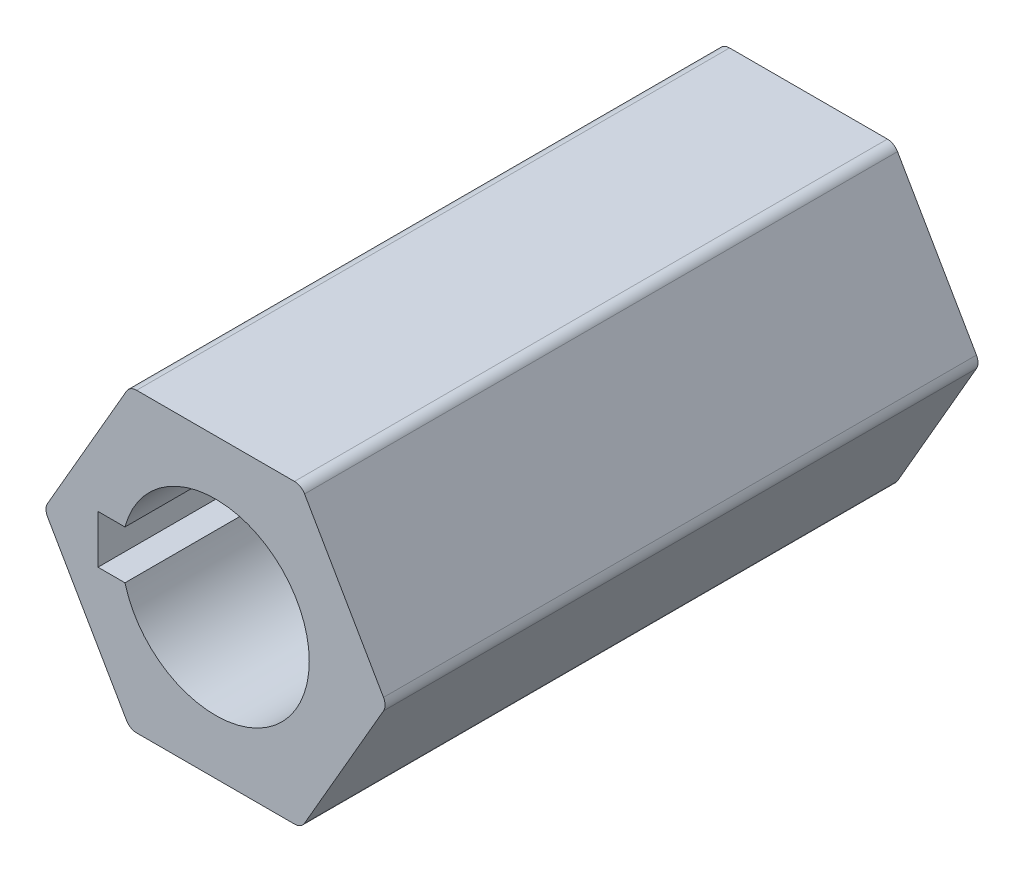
ISO-10303-21;
HEADER;
FILE_DESCRIPTION(('STEP AP214'),'2;1');
FILE_NAME('part.step','',(''),(''),'','','');
FILE_SCHEMA(('AUTOMOTIVE_DESIGN { 1 0 10303 214 1 1 1 1 }'));
ENDSEC;
DATA;
#1=APPLICATION_CONTEXT('core data for automotive mechanical design processes');
#2=APPLICATION_PROTOCOL_DEFINITION('international standard','automotive_design',2000,#1);
#3=PRODUCT_CONTEXT('',#1,'mechanical');
#4=PRODUCT('Part','Part','',(#3));
#5=PRODUCT_RELATED_PRODUCT_CATEGORY('part','',(#4));
#6=PRODUCT_DEFINITION_FORMATION('','',#4);
#7=PRODUCT_DEFINITION_CONTEXT('part definition',#1,'design');
#8=PRODUCT_DEFINITION('design','',#6,#7);
#9=PRODUCT_DEFINITION_SHAPE('','',#8);
#10=(LENGTH_UNIT() NAMED_UNIT(*) SI_UNIT(.MILLI.,.METRE.));
#11=(NAMED_UNIT(*) PLANE_ANGLE_UNIT() SI_UNIT($,.RADIAN.));
#12=(NAMED_UNIT(*) SI_UNIT($,.STERADIAN.) SOLID_ANGLE_UNIT());
#13=UNCERTAINTY_MEASURE_WITH_UNIT(LENGTH_MEASURE(1.E-05),#10,'distance_accuracy_value','');
#14=(GEOMETRIC_REPRESENTATION_CONTEXT(3) GLOBAL_UNCERTAINTY_ASSIGNED_CONTEXT((#13)) GLOBAL_UNIT_ASSIGNED_CONTEXT((#10,
#11,#12)) REPRESENTATION_CONTEXT('',''));
#15=CARTESIAN_POINT('',(0.,0.,0.));
#16=DIRECTION('',(0.,0.,1.));
#17=DIRECTION('',(1.,0.,0.));
#18=AXIS2_PLACEMENT_3D('',#15,#16,#17);
#19=CARTESIAN_POINT('',(6.76233049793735,0.,12.7));
#20=DIRECTION('',(0.,0.,-1.));
#21=DIRECTION('',(-1.,0.,0.));
#22=AXIS2_PLACEMENT_3D('',#19,#20,#21);
#23=CYLINDRICAL_SURFACE('',#22,0.5);
#24=CARTESIAN_POINT('',(6.76233049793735,0.,-12.7));
#25=DIRECTION('',(0.,0.,1.));
#26=DIRECTION('',(-1.,0.,0.));
#27=AXIS2_PLACEMENT_3D('',#24,#25,#26);
#28=CIRCLE('',#27,0.5);
#29=CARTESIAN_POINT('',(7.19534319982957,-0.250000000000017,-12.7));
#30=VERTEX_POINT('',#29);
#31=CARTESIAN_POINT('',(7.19534319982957,0.249999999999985,-12.7));
#32=VERTEX_POINT('',#31);
#33=EDGE_CURVE('E237',#30,#32,#28,.T.);
#34=ORIENTED_EDGE('',*,*,#33,.T.);
#35=DIRECTION('',(0.,0.,1.));
#36=VECTOR('',#35,1.);
#37=CARTESIAN_POINT('',(7.19534319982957,0.249999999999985,12.7));
#38=LINE('',#37,#36);
#39=CARTESIAN_POINT('',(7.19534319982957,0.249999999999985,12.7));
#40=VERTEX_POINT('',#39);
#41=EDGE_CURVE('E142',#32,#40,#38,.T.);
#42=ORIENTED_EDGE('',*,*,#41,.T.);
#43=CARTESIAN_POINT('',(6.76233049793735,0.,12.7));
#44=DIRECTION('',(0.,0.,-1.));
#45=DIRECTION('',(-1.,0.,0.));
#46=AXIS2_PLACEMENT_3D('',#43,#44,#45);
#47=CIRCLE('',#46,0.5);
#48=CARTESIAN_POINT('',(7.19534319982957,-0.250000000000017,12.7));
#49=VERTEX_POINT('',#48);
#50=EDGE_CURVE('E222',#40,#49,#47,.T.);
#51=ORIENTED_EDGE('',*,*,#50,.T.);
#52=DIRECTION('',(0.,0.,-1.));
#53=VECTOR('',#52,1.);
#54=CARTESIAN_POINT('',(7.19534319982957,-0.250000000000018,12.7));
#55=LINE('',#54,#53);
#56=EDGE_CURVE('E10',#49,#30,#55,.T.);
#57=ORIENTED_EDGE('',*,*,#56,.T.);
#58=EDGE_LOOP('',(#34,#42,#51,#57));
#59=FACE_BOUND('',#58,.T.);
#60=ADVANCED_FACE('F16',(#59),#23,.T.);
#61=CARTESIAN_POINT('',(3.38116524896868,5.85635,12.7));
#62=DIRECTION('',(0.,0.,-1.));
#63=DIRECTION('',(-1.,0.,0.));
#64=AXIS2_PLACEMENT_3D('',#61,#62,#63);
#65=CYLINDRICAL_SURFACE('',#64,0.5);
#66=CARTESIAN_POINT('',(3.38116524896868,5.85635,-12.7));
#67=DIRECTION('',(0.,0.,1.));
#68=DIRECTION('',(-1.,0.,0.));
#69=AXIS2_PLACEMENT_3D('',#66,#67,#68);
#70=CIRCLE('',#69,0.5);
#71=CARTESIAN_POINT('',(3.81417795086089,6.10635,-12.7));
#72=VERTEX_POINT('',#71);
#73=CARTESIAN_POINT('',(3.38116524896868,6.35635,-12.7));
#74=VERTEX_POINT('',#73);
#75=EDGE_CURVE('E195',#72,#74,#70,.T.);
#76=ORIENTED_EDGE('',*,*,#75,.T.);
#77=DIRECTION('',(0.,0.,1.));
#78=VECTOR('',#77,1.);
#79=CARTESIAN_POINT('',(3.38116524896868,6.35635,12.7));
#80=LINE('',#79,#78);
#81=CARTESIAN_POINT('',(3.38116524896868,6.35635,12.7));
#82=VERTEX_POINT('',#81);
#83=EDGE_CURVE('E188',#74,#82,#80,.T.);
#84=ORIENTED_EDGE('',*,*,#83,.T.);
#85=CARTESIAN_POINT('',(3.38116524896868,5.85635,12.7));
#86=DIRECTION('',(0.,0.,-1.));
#87=DIRECTION('',(-1.,0.,0.));
#88=AXIS2_PLACEMENT_3D('',#85,#86,#87);
#89=CIRCLE('',#88,0.5);
#90=CARTESIAN_POINT('',(3.81417795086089,6.10635,12.7));
#91=VERTEX_POINT('',#90);
#92=EDGE_CURVE('E192',#82,#91,#89,.T.);
#93=ORIENTED_EDGE('',*,*,#92,.T.);
#94=DIRECTION('',(0.,0.,-1.));
#95=VECTOR('',#94,1.);
#96=CARTESIAN_POINT('',(3.81417795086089,6.10635,12.7));
#97=LINE('',#96,#95);
#98=EDGE_CURVE('E178',#91,#72,#97,.T.);
#99=ORIENTED_EDGE('',*,*,#98,.T.);
#100=EDGE_LOOP('',(#76,#84,#93,#99));
#101=FACE_BOUND('',#100,.T.);
#102=ADVANCED_FACE('F190',(#101),#65,.T.);
#103=CARTESIAN_POINT('',(-3.38116524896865,5.85635,12.7));
#104=DIRECTION('',(0.,0.,-1.));
#105=DIRECTION('',(-1.,0.,0.));
#106=AXIS2_PLACEMENT_3D('',#103,#104,#105);
#107=CYLINDRICAL_SURFACE('',#106,0.5);
#108=CARTESIAN_POINT('',(-3.38116524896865,5.85635,-12.7));
#109=DIRECTION('',(0.,0.,1.));
#110=DIRECTION('',(-1.,0.,0.));
#111=AXIS2_PLACEMENT_3D('',#108,#109,#110);
#112=CIRCLE('',#111,0.5);
#113=CARTESIAN_POINT('',(-3.38116524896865,6.35635,-12.7));
#114=VERTEX_POINT('',#113);
#115=CARTESIAN_POINT('',(-3.81417795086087,6.10635,-12.7));
#116=VERTEX_POINT('',#115);
#117=EDGE_CURVE('E231',#114,#116,#112,.T.);
#118=ORIENTED_EDGE('',*,*,#117,.T.);
#119=DIRECTION('',(0.,0.,1.));
#120=VECTOR('',#119,1.);
#121=CARTESIAN_POINT('',(-3.81417795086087,6.10635,12.7));
#122=LINE('',#121,#120);
#123=CARTESIAN_POINT('',(-3.81417795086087,6.10635,12.7));
#124=VERTEX_POINT('',#123);
#125=EDGE_CURVE('E323',#116,#124,#122,.T.);
#126=ORIENTED_EDGE('',*,*,#125,.T.);
#127=CARTESIAN_POINT('',(-3.38116524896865,5.85635,12.7));
#128=DIRECTION('',(0.,0.,-1.));
#129=DIRECTION('',(-1.,0.,0.));
#130=AXIS2_PLACEMENT_3D('',#127,#128,#129);
#131=CIRCLE('',#130,0.5);
#132=CARTESIAN_POINT('',(-3.38116524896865,6.35635,12.7));
#133=VERTEX_POINT('',#132);
#134=EDGE_CURVE('E210',#124,#133,#131,.T.);
#135=ORIENTED_EDGE('',*,*,#134,.T.);
#136=DIRECTION('',(0.,0.,-1.));
#137=VECTOR('',#136,1.);
#138=CARTESIAN_POINT('',(-3.38116524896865,6.35635,12.7));
#139=LINE('',#138,#137);
#140=EDGE_CURVE('E200',#133,#114,#139,.T.);
#141=ORIENTED_EDGE('',*,*,#140,.T.);
#142=EDGE_LOOP('',(#118,#126,#135,#141));
#143=FACE_BOUND('',#142,.T.);
#144=ADVANCED_FACE('F711',(#143),#107,.T.);
#145=CARTESIAN_POINT('',(-6.76233049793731,0.,12.7));
#146=DIRECTION('',(0.,0.,-1.));
#147=DIRECTION('',(-1.,0.,0.));
#148=AXIS2_PLACEMENT_3D('',#145,#146,#147);
#149=CYLINDRICAL_SURFACE('',#148,0.5);
#150=DIRECTION('',(0.,0.,-1.));
#151=VECTOR('',#150,1.);
#152=CARTESIAN_POINT('',(-7.26233049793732,0.,12.7));
#153=LINE('',#152,#151);
#154=CARTESIAN_POINT('',(-7.26233049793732,0.,12.7));
#155=VERTEX_POINT('',#154);
#156=CARTESIAN_POINT('',(-7.26233049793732,0.,-12.7));
#157=VERTEX_POINT('',#156);
#158=EDGE_CURVE('E306',#155,#157,#153,.T.);
#159=ORIENTED_EDGE('',*,*,#158,.F.);
#160=CARTESIAN_POINT('',(-6.76233049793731,0.,12.7));
#161=DIRECTION('',(0.,0.,-1.));
#162=DIRECTION('',(-1.,0.,0.));
#163=AXIS2_PLACEMENT_3D('',#160,#161,#162);
#164=CIRCLE('',#163,0.5);
#165=CARTESIAN_POINT('',(-7.19534319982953,0.25,12.7));
#166=VERTEX_POINT('',#165);
#167=EDGE_CURVE('E272',#155,#166,#164,.T.);
#168=ORIENTED_EDGE('',*,*,#167,.T.);
#169=DIRECTION('',(0.,0.,-1.));
#170=VECTOR('',#169,1.);
#171=CARTESIAN_POINT('',(-7.19534319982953,0.249999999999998,12.7));
#172=LINE('',#171,#170);
#173=CARTESIAN_POINT('',(-7.19534319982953,0.25,-12.7));
#174=VERTEX_POINT('',#173);
#175=EDGE_CURVE('E327',#166,#174,#172,.T.);
#176=ORIENTED_EDGE('',*,*,#175,.T.);
#177=CARTESIAN_POINT('',(-6.76233049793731,0.,-12.7));
#178=DIRECTION('',(0.,0.,1.));
#179=DIRECTION('',(-1.,0.,0.));
#180=AXIS2_PLACEMENT_3D('',#177,#178,#179);
#181=CIRCLE('',#180,0.5);
#182=EDGE_CURVE('E281',#174,#157,#181,.T.);
#183=ORIENTED_EDGE('',*,*,#182,.T.);
#184=EDGE_LOOP('',(#159,#168,#176,#183));
#185=FACE_BOUND('',#184,.T.);
#186=ADVANCED_FACE('F707',(#185),#149,.T.);
#187=CARTESIAN_POINT('',(3.38116524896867,-5.85635,12.7));
#188=DIRECTION('',(0.,0.,-1.));
#189=DIRECTION('',(-1.,0.,0.));
#190=AXIS2_PLACEMENT_3D('',#187,#188,#189);
#191=CYLINDRICAL_SURFACE('',#190,0.5);
#192=CARTESIAN_POINT('',(3.38116524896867,-5.85635,-12.7));
#193=DIRECTION('',(0.,0.,1.));
#194=DIRECTION('',(-1.,0.,0.));
#195=AXIS2_PLACEMENT_3D('',#192,#193,#194);
#196=CIRCLE('',#195,0.5);
#197=CARTESIAN_POINT('',(3.38116524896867,-6.35635,-12.7));
#198=VERTEX_POINT('',#197);
#199=CARTESIAN_POINT('',(3.81417795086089,-6.10635,-12.7));
#200=VERTEX_POINT('',#199);
#201=EDGE_CURVE('E242',#198,#200,#196,.T.);
#202=ORIENTED_EDGE('',*,*,#201,.T.);
#203=DIRECTION('',(0.,0.,1.));
#204=VECTOR('',#203,1.);
#205=CARTESIAN_POINT('',(3.81417795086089,-6.10635,12.7));
#206=LINE('',#205,#204);
#207=CARTESIAN_POINT('',(3.81417795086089,-6.10635,12.7));
#208=VERTEX_POINT('',#207);
#209=EDGE_CURVE('E27',#200,#208,#206,.T.);
#210=ORIENTED_EDGE('',*,*,#209,.T.);
#211=CARTESIAN_POINT('',(3.38116524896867,-5.85635,12.7));
#212=DIRECTION('',(0.,0.,-1.));
#213=DIRECTION('',(-1.,0.,0.));
#214=AXIS2_PLACEMENT_3D('',#211,#212,#213);
#215=CIRCLE('',#214,0.5);
#216=CARTESIAN_POINT('',(3.38116524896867,-6.35635,12.7));
#217=VERTEX_POINT('',#216);
#218=EDGE_CURVE('E317',#208,#217,#215,.T.);
#219=ORIENTED_EDGE('',*,*,#218,.T.);
#220=DIRECTION('',(0.,0.,-1.));
#221=VECTOR('',#220,1.);
#222=CARTESIAN_POINT('',(3.38116524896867,-6.35635,12.7));
#223=LINE('',#222,#221);
#224=EDGE_CURVE('E255',#217,#198,#223,.T.);
#225=ORIENTED_EDGE('',*,*,#224,.T.);
#226=EDGE_LOOP('',(#202,#210,#219,#225));
#227=FACE_BOUND('',#226,.T.);
#228=ADVANCED_FACE('F387',(#227),#191,.T.);
#229=CARTESIAN_POINT('',(-3.38116524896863,-5.85635,12.7));
#230=DIRECTION('',(0.,0.,-1.));
#231=DIRECTION('',(-1.,0.,0.));
#232=AXIS2_PLACEMENT_3D('',#229,#230,#231);
#233=CYLINDRICAL_SURFACE('',#232,0.5);
#234=CARTESIAN_POINT('',(-3.38116524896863,-5.85635,-12.7));
#235=DIRECTION('',(0.,0.,1.));
#236=DIRECTION('',(-1.,0.,0.));
#237=AXIS2_PLACEMENT_3D('',#234,#235,#236);
#238=CIRCLE('',#237,0.5);
#239=CARTESIAN_POINT('',(-3.81417795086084,-6.10635,-12.7));
#240=VERTEX_POINT('',#239);
#241=CARTESIAN_POINT('',(-3.38116524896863,-6.35635,-12.7));
#242=VERTEX_POINT('',#241);
#243=EDGE_CURVE('E299',#240,#242,#238,.T.);
#244=ORIENTED_EDGE('',*,*,#243,.T.);
#245=DIRECTION('',(0.,0.,1.));
#246=VECTOR('',#245,1.);
#247=CARTESIAN_POINT('',(-3.38116524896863,-6.35635,12.7));
#248=LINE('',#247,#246);
#249=CARTESIAN_POINT('',(-3.38116524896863,-6.35635,12.7));
#250=VERTEX_POINT('',#249);
#251=EDGE_CURVE('E260',#242,#250,#248,.T.);
#252=ORIENTED_EDGE('',*,*,#251,.T.);
#253=CARTESIAN_POINT('',(-3.38116524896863,-5.85635,12.7));
#254=DIRECTION('',(0.,0.,-1.));
#255=DIRECTION('',(-1.,0.,0.));
#256=AXIS2_PLACEMENT_3D('',#253,#254,#255);
#257=CIRCLE('',#256,0.5);
#258=CARTESIAN_POINT('',(-3.81417795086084,-6.10635,12.7));
#259=VERTEX_POINT('',#258);
#260=EDGE_CURVE('E249',#250,#259,#257,.T.);
#261=ORIENTED_EDGE('',*,*,#260,.T.);
#262=DIRECTION('',(0.,0.,-1.));
#263=VECTOR('',#262,1.);
#264=CARTESIAN_POINT('',(-3.81417795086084,-6.10635,12.7));
#265=LINE('',#264,#263);
#266=EDGE_CURVE('E259',#259,#240,#265,.T.);
#267=ORIENTED_EDGE('',*,*,#266,.T.);
#268=EDGE_LOOP('',(#244,#252,#261,#267));
#269=FACE_BOUND('',#268,.T.);
#270=ADVANCED_FACE('F391',(#269),#233,.T.);
#271=CARTESIAN_POINT('',(3.66984038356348,-6.35635,12.7));
#272=DIRECTION('',(-0.866025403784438,0.5,0.));
#273=DIRECTION('',(0.,0.,1.));
#274=AXIS2_PLACEMENT_3D('',#271,#272,#273);
#275=PLANE('',#274);
#276=ORIENTED_EDGE('',*,*,#209,.F.);
#277=DIRECTION('',(0.5,0.866025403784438,0.));
#278=VECTOR('',#277,1.);
#279=CARTESIAN_POINT('',(3.81417795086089,-6.10635,-12.7));
#280=LINE('',#279,#278);
#281=EDGE_CURVE('E239',#200,#30,#280,.T.);
#282=ORIENTED_EDGE('',*,*,#281,.T.);
#283=ORIENTED_EDGE('',*,*,#56,.F.);
#284=DIRECTION('',(0.5,0.866025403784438,0.));
#285=VECTOR('',#284,1.);
#286=CARTESIAN_POINT('',(3.81417795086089,-6.10635,12.7));
#287=LINE('',#286,#285);
#288=EDGE_CURVE('E293',#208,#49,#287,.T.);
#289=ORIENTED_EDGE('',*,*,#288,.F.);
#290=EDGE_LOOP('',(#276,#282,#283,#289));
#291=FACE_BOUND('',#290,.T.);
#292=ADVANCED_FACE('F688',(#291),#275,.F.);
#293=CARTESIAN_POINT('',(7.33968076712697,0.,12.7));
#294=DIRECTION('',(-0.866025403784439,-0.5,0.));
#295=DIRECTION('',(-0.5,0.866025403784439,0.));
#296=AXIS2_PLACEMENT_3D('',#293,#294,#295);
#297=PLANE('',#296);
#298=ORIENTED_EDGE('',*,*,#41,.F.);
#299=DIRECTION('',(-0.5,0.866025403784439,0.));
#300=VECTOR('',#299,1.);
#301=CARTESIAN_POINT('',(7.19534319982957,0.249999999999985,-12.7));
#302=LINE('',#301,#300);
#303=EDGE_CURVE('E240',#32,#72,#302,.T.);
#304=ORIENTED_EDGE('',*,*,#303,.T.);
#305=ORIENTED_EDGE('',*,*,#98,.F.);
#306=DIRECTION('',(-0.5,0.866025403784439,0.));
#307=VECTOR('',#306,1.);
#308=CARTESIAN_POINT('',(7.19534319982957,0.249999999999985,12.7));
#309=LINE('',#308,#307);
#310=EDGE_CURVE('E215',#40,#91,#309,.T.);
#311=ORIENTED_EDGE('',*,*,#310,.F.);
#312=EDGE_LOOP('',(#298,#304,#305,#311));
#313=FACE_BOUND('',#312,.T.);
#314=ADVANCED_FACE('F684',(#313),#297,.F.);
#315=CARTESIAN_POINT('',(3.66984038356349,6.35635,12.7));
#316=DIRECTION('',(0.,-1.,0.));
#317=DIRECTION('',(0.,0.,-1.));
#318=AXIS2_PLACEMENT_3D('',#315,#316,#317);
#319=PLANE('',#318);
#320=ORIENTED_EDGE('',*,*,#140,.F.);
#321=DIRECTION('',(-1.,0.,0.));
#322=VECTOR('',#321,1.);
#323=CARTESIAN_POINT('',(0.,6.35635,12.7));
#324=LINE('',#323,#322);
#325=EDGE_CURVE('E203',#82,#133,#324,.T.);
#326=ORIENTED_EDGE('',*,*,#325,.F.);
#327=ORIENTED_EDGE('',*,*,#83,.F.);
#328=DIRECTION('',(-1.,0.,0.));
#329=VECTOR('',#328,1.);
#330=CARTESIAN_POINT('',(0.,6.35635,-12.7));
#331=LINE('',#330,#329);
#332=EDGE_CURVE('E235',#74,#114,#331,.T.);
#333=ORIENTED_EDGE('',*,*,#332,.T.);
#334=EDGE_LOOP('',(#320,#326,#327,#333));
#335=FACE_BOUND('',#334,.T.);
#336=ADVANCED_FACE('F204',(#335),#319,.F.);
#337=CARTESIAN_POINT('',(-3.66984038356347,6.35635,12.7));
#338=DIRECTION('',(0.866025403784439,-0.5,0.));
#339=DIRECTION('',(0.,0.,-1.));
#340=AXIS2_PLACEMENT_3D('',#337,#338,#339);
#341=PLANE('',#340);
#342=ORIENTED_EDGE('',*,*,#175,.F.);
#343=DIRECTION('',(-0.5,-0.866025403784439,0.));
#344=VECTOR('',#343,1.);
#345=CARTESIAN_POINT('',(-3.81417795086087,6.10635,12.7));
#346=LINE('',#345,#344);
#347=EDGE_CURVE('E276',#124,#166,#346,.T.);
#348=ORIENTED_EDGE('',*,*,#347,.F.);
#349=ORIENTED_EDGE('',*,*,#125,.F.);
#350=DIRECTION('',(-0.5,-0.866025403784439,0.));
#351=VECTOR('',#350,1.);
#352=CARTESIAN_POINT('',(-3.81417795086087,6.10635,-12.7));
#353=LINE('',#352,#351);
#354=EDGE_CURVE('E236',#116,#174,#353,.T.);
#355=ORIENTED_EDGE('',*,*,#354,.T.);
#356=EDGE_LOOP('',(#342,#348,#349,#355));
#357=FACE_BOUND('',#356,.T.);
#358=ADVANCED_FACE('F363',(#357),#341,.F.);
#359=CARTESIAN_POINT('',(-7.33968076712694,0.,12.7));
#360=DIRECTION('',(0.866025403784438,0.5,0.));
#361=DIRECTION('',(0.,0.,-1.));
#362=AXIS2_PLACEMENT_3D('',#359,#360,#361);
#363=PLANE('',#362);
#364=ORIENTED_EDGE('',*,*,#266,.F.);
#365=DIRECTION('',(0.5,-0.866025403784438,0.));
#366=VECTOR('',#365,1.);
#367=CARTESIAN_POINT('',(-7.19534319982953,-0.25,12.7));
#368=LINE('',#367,#366);
#369=CARTESIAN_POINT('',(-7.19534319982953,-0.25,12.7));
#370=VERTEX_POINT('',#369);
#371=EDGE_CURVE('E254',#370,#259,#368,.T.);
#372=ORIENTED_EDGE('',*,*,#371,.F.);
#373=DIRECTION('',(0.,0.,1.));
#374=VECTOR('',#373,1.);
#375=CARTESIAN_POINT('',(-7.19534319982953,-0.25,12.7));
#376=LINE('',#375,#374);
#377=CARTESIAN_POINT('',(-7.19534319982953,-0.25,-12.7));
#378=VERTEX_POINT('',#377);
#379=EDGE_CURVE('E307',#378,#370,#376,.T.);
#380=ORIENTED_EDGE('',*,*,#379,.F.);
#381=DIRECTION('',(0.5,-0.866025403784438,0.));
#382=VECTOR('',#381,1.);
#383=CARTESIAN_POINT('',(-7.19534319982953,-0.25,-12.7));
#384=LINE('',#383,#382);
#385=EDGE_CURVE('E285',#378,#240,#384,.T.);
#386=ORIENTED_EDGE('',*,*,#385,.T.);
#387=EDGE_LOOP('',(#364,#372,#380,#386));
#388=FACE_BOUND('',#387,.T.);
#389=ADVANCED_FACE('F765',(#388),#363,.F.);
#390=CARTESIAN_POINT('',(-3.66984038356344,-6.35635,12.7));
#391=DIRECTION('',(0.,1.,0.));
#392=DIRECTION('',(1.,0.,0.));
#393=AXIS2_PLACEMENT_3D('',#390,#391,#392);
#394=PLANE('',#393);
#395=ORIENTED_EDGE('',*,*,#251,.F.);
#396=DIRECTION('',(1.,0.,0.));
#397=VECTOR('',#396,1.);
#398=CARTESIAN_POINT('',(0.,-6.35635,-12.7));
#399=LINE('',#398,#397);
#400=EDGE_CURVE('E245',#242,#198,#399,.T.);
#401=ORIENTED_EDGE('',*,*,#400,.T.);
#402=ORIENTED_EDGE('',*,*,#224,.F.);
#403=DIRECTION('',(1.,0.,0.));
#404=VECTOR('',#403,1.);
#405=CARTESIAN_POINT('',(0.,-6.35635,12.7));
#406=LINE('',#405,#404);
#407=EDGE_CURVE('E253',#250,#217,#406,.T.);
#408=ORIENTED_EDGE('',*,*,#407,.F.);
#409=EDGE_LOOP('',(#395,#401,#402,#408));
#410=FACE_BOUND('',#409,.T.);
#411=ADVANCED_FACE('F381',(#410),#394,.F.);
#412=CARTESIAN_POINT('',(-5.035,-1.035,12.7));
#413=DIRECTION('',(1.,0.,0.));
#414=DIRECTION('',(0.,1.,0.));
#415=AXIS2_PLACEMENT_3D('',#412,#413,#414);
#416=PLANE('',#415);
#417=DIRECTION('',(0.,1.,0.));
#418=VECTOR('',#417,1.);
#419=CARTESIAN_POINT('',(-5.035,0.,12.7));
#420=LINE('',#419,#418);
#421=CARTESIAN_POINT('',(-5.035,-1.035,12.7));
#422=VERTEX_POINT('',#421);
#423=CARTESIAN_POINT('',(-5.035,1.035,12.7));
#424=VERTEX_POINT('',#423);
#425=EDGE_CURVE('E230',#422,#424,#420,.T.);
#426=ORIENTED_EDGE('',*,*,#425,.F.);
#427=DIRECTION('',(0.,0.,1.));
#428=VECTOR('',#427,1.);
#429=CARTESIAN_POINT('',(-5.035,-1.035,12.7));
#430=LINE('',#429,#428);
#431=CARTESIAN_POINT('',(-5.035,-1.035,-12.7));
#432=VERTEX_POINT('',#431);
#433=EDGE_CURVE('E286',#432,#422,#430,.T.);
#434=ORIENTED_EDGE('',*,*,#433,.F.);
#435=DIRECTION('',(0.,1.,0.));
#436=VECTOR('',#435,1.);
#437=CARTESIAN_POINT('',(-5.035,0.,-12.7));
#438=LINE('',#437,#436);
#439=CARTESIAN_POINT('',(-5.035,1.035,-12.7));
#440=VERTEX_POINT('',#439);
#441=EDGE_CURVE('E263',#432,#440,#438,.T.);
#442=ORIENTED_EDGE('',*,*,#441,.T.);
#443=DIRECTION('',(0.,0.,-1.));
#444=VECTOR('',#443,1.);
#445=CARTESIAN_POINT('',(-5.035,1.035,12.7));
#446=LINE('',#445,#444);
#447=EDGE_CURVE('E42',#424,#440,#446,.T.);
#448=ORIENTED_EDGE('',*,*,#447,.F.);
#449=EDGE_LOOP('',(#426,#434,#442,#448));
#450=FACE_BOUND('',#449,.T.);
#451=ADVANCED_FACE('F405',(#450),#416,.T.);
#452=CARTESIAN_POINT('',(-3.87930406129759,1.035,12.7));
#453=DIRECTION('',(0.,-1.,0.));
#454=DIRECTION('',(-1.,0.,0.));
#455=AXIS2_PLACEMENT_3D('',#452,#453,#454);
#456=PLANE('',#455);
#457=DIRECTION('',(1.,0.,0.));
#458=VECTOR('',#457,1.);
#459=CARTESIAN_POINT('',(0.,1.035,12.7));
#460=LINE('',#459,#458);
#461=CARTESIAN_POINT('',(-3.87930406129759,1.035,12.7));
#462=VERTEX_POINT('',#461);
#463=EDGE_CURVE('E66',#424,#462,#460,.T.);
#464=ORIENTED_EDGE('',*,*,#463,.F.);
#465=ORIENTED_EDGE('',*,*,#447,.T.);
#466=DIRECTION('',(1.,0.,0.));
#467=VECTOR('',#466,1.);
#468=CARTESIAN_POINT('',(0.,1.035,-12.7));
#469=LINE('',#468,#467);
#470=CARTESIAN_POINT('',(-3.87930406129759,1.035,-12.7));
#471=VERTEX_POINT('',#470);
#472=EDGE_CURVE('E266',#440,#471,#469,.T.);
#473=ORIENTED_EDGE('',*,*,#472,.T.);
#474=DIRECTION('',(0.,0.,1.));
#475=VECTOR('',#474,1.);
#476=CARTESIAN_POINT('',(-3.87930406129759,1.035,12.7));
#477=LINE('',#476,#475);
#478=EDGE_CURVE('E20',#471,#462,#477,.T.);
#479=ORIENTED_EDGE('',*,*,#478,.T.);
#480=EDGE_LOOP('',(#464,#465,#473,#479));
#481=FACE_BOUND('',#480,.T.);
#482=ADVANCED_FACE('F403',(#481),#456,.T.);
#483=CARTESIAN_POINT('',(0.,0.,12.7));
#484=DIRECTION('',(0.,0.,1.));
#485=DIRECTION('',(1.,0.,0.));
#486=AXIS2_PLACEMENT_3D('',#483,#484,#485);
#487=PLANE('',#486);
#488=DIRECTION('',(1.,0.,0.));
#489=VECTOR('',#488,1.);
#490=CARTESIAN_POINT('',(-3.87930406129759,-1.035,12.7));
#491=LINE('',#490,#489);
#492=CARTESIAN_POINT('',(-3.87930406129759,-1.035,12.7));
#493=VERTEX_POINT('',#492);
#494=EDGE_CURVE('E290',#422,#493,#491,.T.);
#495=ORIENTED_EDGE('',*,*,#494,.F.);
#496=ORIENTED_EDGE('',*,*,#425,.T.);
#497=ORIENTED_EDGE('',*,*,#463,.T.);
#498=CARTESIAN_POINT('',(0.,0.,12.7));
#499=DIRECTION('',(0.,0.,-1.));
#500=DIRECTION('',(-1.,0.,0.));
#501=AXIS2_PLACEMENT_3D('',#498,#499,#500);
#502=CIRCLE('',#501,4.015);
#503=EDGE_CURVE('E336',#462,#493,#502,.T.);
#504=ORIENTED_EDGE('',*,*,#503,.T.);
#505=EDGE_LOOP('',(#495,#496,#497,#504));
#506=FACE_BOUND('',#505,.T.);
#507=ORIENTED_EDGE('',*,*,#347,.T.);
#508=ORIENTED_EDGE('',*,*,#167,.F.);
#509=CARTESIAN_POINT('',(-6.76233049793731,0.,12.7));
#510=DIRECTION('',(0.,0.,-1.));
#511=DIRECTION('',(-1.,0.,0.));
#512=AXIS2_PLACEMENT_3D('',#509,#510,#511);
#513=CIRCLE('',#512,0.5);
#514=EDGE_CURVE('E302',#370,#155,#513,.T.);
#515=ORIENTED_EDGE('',*,*,#514,.F.);
#516=ORIENTED_EDGE('',*,*,#371,.T.);
#517=ORIENTED_EDGE('',*,*,#260,.F.);
#518=ORIENTED_EDGE('',*,*,#407,.T.);
#519=ORIENTED_EDGE('',*,*,#218,.F.);
#520=ORIENTED_EDGE('',*,*,#288,.T.);
#521=ORIENTED_EDGE('',*,*,#50,.F.);
#522=ORIENTED_EDGE('',*,*,#310,.T.);
#523=ORIENTED_EDGE('',*,*,#92,.F.);
#524=ORIENTED_EDGE('',*,*,#325,.T.);
#525=ORIENTED_EDGE('',*,*,#134,.F.);
#526=EDGE_LOOP('',(#507,#508,#515,#516,#517,#518,#519,#520,#521,#522,#523,#524,#525));
#527=FACE_BOUND('',#526,.T.);
#528=ADVANCED_FACE('F213',(#506,#527),#487,.T.);
#529=CARTESIAN_POINT('',(-3.87930406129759,-1.035,12.7));
#530=DIRECTION('',(0.,1.,0.));
#531=DIRECTION('',(1.,0.,0.));
#532=AXIS2_PLACEMENT_3D('',#529,#530,#531);
#533=PLANE('',#532);
#534=ORIENTED_EDGE('',*,*,#494,.T.);
#535=DIRECTION('',(0.,0.,-1.));
#536=VECTOR('',#535,1.);
#537=CARTESIAN_POINT('',(-3.87930406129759,-1.035,12.7));
#538=LINE('',#537,#536);
#539=CARTESIAN_POINT('',(-3.87930406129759,-1.035,-12.7));
#540=VERTEX_POINT('',#539);
#541=EDGE_CURVE('E226',#493,#540,#538,.T.);
#542=ORIENTED_EDGE('',*,*,#541,.T.);
#543=DIRECTION('',(-1.,0.,0.));
#544=VECTOR('',#543,1.);
#545=CARTESIAN_POINT('',(0.,-1.035,-12.7));
#546=LINE('',#545,#544);
#547=EDGE_CURVE('E84',#540,#432,#546,.T.);
#548=ORIENTED_EDGE('',*,*,#547,.T.);
#549=ORIENTED_EDGE('',*,*,#433,.T.);
#550=EDGE_LOOP('',(#534,#542,#548,#549));
#551=FACE_BOUND('',#550,.T.);
#552=ADVANCED_FACE('F750',(#551),#533,.T.);
#553=CARTESIAN_POINT('',(0.,0.,-12.7));
#554=DIRECTION('',(0.,0.,1.));
#555=DIRECTION('',(1.,0.,0.));
#556=AXIS2_PLACEMENT_3D('',#553,#554,#555);
#557=PLANE('',#556);
#558=ORIENTED_EDGE('',*,*,#472,.F.);
#559=ORIENTED_EDGE('',*,*,#441,.F.);
#560=ORIENTED_EDGE('',*,*,#547,.F.);
#561=CARTESIAN_POINT('',(0.,0.,-12.7));
#562=DIRECTION('',(0.,0.,1.));
#563=DIRECTION('',(-1.,0.,0.));
#564=AXIS2_PLACEMENT_3D('',#561,#562,#563);
#565=CIRCLE('',#564,4.015);
#566=EDGE_CURVE('E296',#540,#471,#565,.T.);
#567=ORIENTED_EDGE('',*,*,#566,.T.);
#568=EDGE_LOOP('',(#558,#559,#560,#567));
#569=FACE_BOUND('',#568,.T.);
#570=ORIENTED_EDGE('',*,*,#243,.F.);
#571=ORIENTED_EDGE('',*,*,#385,.F.);
#572=CARTESIAN_POINT('',(-6.76233049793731,0.,-12.7));
#573=DIRECTION('',(0.,0.,1.));
#574=DIRECTION('',(-1.,0.,0.));
#575=AXIS2_PLACEMENT_3D('',#572,#573,#574);
#576=CIRCLE('',#575,0.5);
#577=EDGE_CURVE('E311',#157,#378,#576,.T.);
#578=ORIENTED_EDGE('',*,*,#577,.F.);
#579=ORIENTED_EDGE('',*,*,#182,.F.);
#580=ORIENTED_EDGE('',*,*,#354,.F.);
#581=ORIENTED_EDGE('',*,*,#117,.F.);
#582=ORIENTED_EDGE('',*,*,#332,.F.);
#583=ORIENTED_EDGE('',*,*,#75,.F.);
#584=ORIENTED_EDGE('',*,*,#303,.F.);
#585=ORIENTED_EDGE('',*,*,#33,.F.);
#586=ORIENTED_EDGE('',*,*,#281,.F.);
#587=ORIENTED_EDGE('',*,*,#201,.F.);
#588=ORIENTED_EDGE('',*,*,#400,.F.);
#589=EDGE_LOOP('',(#570,#571,#578,#579,#580,#581,#582,#583,#584,#585,#586,#587,#588));
#590=FACE_BOUND('',#589,.T.);
#591=ADVANCED_FACE('F18',(#569,#590),#557,.F.);
#592=CARTESIAN_POINT('',(0.,0.,12.7));
#593=DIRECTION('',(0.,0.,-1.));
#594=DIRECTION('',(-1.,0.,0.));
#595=AXIS2_PLACEMENT_3D('',#592,#593,#594);
#596=CYLINDRICAL_SURFACE('',#595,4.015);
#597=ORIENTED_EDGE('',*,*,#541,.F.);
#598=ORIENTED_EDGE('',*,*,#503,.F.);
#599=ORIENTED_EDGE('',*,*,#478,.F.);
#600=ORIENTED_EDGE('',*,*,#566,.F.);
#601=EDGE_LOOP('',(#597,#598,#599,#600));
#602=FACE_BOUND('',#601,.T.);
#603=ADVANCED_FACE('F411',(#602),#596,.F.);
#604=CARTESIAN_POINT('',(-6.76233049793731,0.,12.7));
#605=DIRECTION('',(0.,0.,-1.));
#606=DIRECTION('',(-1.,0.,0.));
#607=AXIS2_PLACEMENT_3D('',#604,#605,#606);
#608=CYLINDRICAL_SURFACE('',#607,0.5);
#609=ORIENTED_EDGE('',*,*,#514,.T.);
#610=ORIENTED_EDGE('',*,*,#158,.T.);
#611=ORIENTED_EDGE('',*,*,#577,.T.);
#612=ORIENTED_EDGE('',*,*,#379,.T.);
#613=EDGE_LOOP('',(#609,#610,#611,#612));
#614=FACE_BOUND('',#613,.T.);
#615=ADVANCED_FACE('F699',(#614),#608,.T.);
#616=CLOSED_SHELL('',(#60,#102,#144,#186,#228,#270,#292,#314,#336,#358,#389,#411,#451,#482,#528,
#552,#591,#603,#615));
#617=MANIFOLD_SOLID_BREP('B1',#616);
#618=ADVANCED_BREP_SHAPE_REPRESENTATION('',(#18,#617),#14);
#619=SHAPE_DEFINITION_REPRESENTATION(#9,#618);
ENDSEC;
END-ISO-10303-21;
